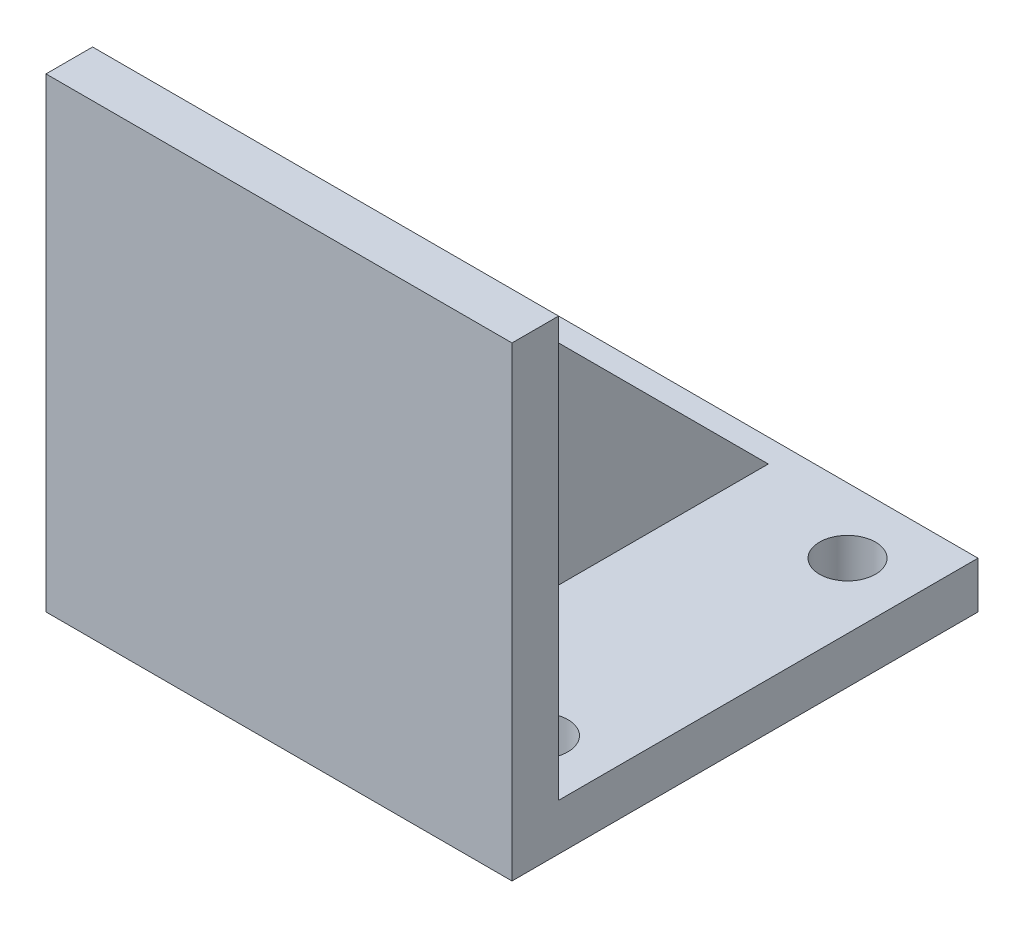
ISO-10303-21;
HEADER;
FILE_DESCRIPTION(('STEP AP214'),'2;1');
FILE_NAME('part.step','',(''),(''),'','','');
FILE_SCHEMA(('AUTOMOTIVE_DESIGN { 1 0 10303 214 1 1 1 1 }'));
ENDSEC;
DATA;
#1=APPLICATION_CONTEXT('core data for automotive mechanical design processes');
#2=APPLICATION_PROTOCOL_DEFINITION('international standard','automotive_design',2000,#1);
#3=PRODUCT_CONTEXT('',#1,'mechanical');
#4=PRODUCT('Part','Part','',(#3));
#5=PRODUCT_RELATED_PRODUCT_CATEGORY('part','',(#4));
#6=PRODUCT_DEFINITION_FORMATION('','',#4);
#7=PRODUCT_DEFINITION_CONTEXT('part definition',#1,'design');
#8=PRODUCT_DEFINITION('design','',#6,#7);
#9=PRODUCT_DEFINITION_SHAPE('','',#8);
#10=(LENGTH_UNIT() NAMED_UNIT(*) SI_UNIT(.MILLI.,.METRE.));
#11=(NAMED_UNIT(*) PLANE_ANGLE_UNIT() SI_UNIT($,.RADIAN.));
#12=(NAMED_UNIT(*) SI_UNIT($,.STERADIAN.) SOLID_ANGLE_UNIT());
#13=UNCERTAINTY_MEASURE_WITH_UNIT(LENGTH_MEASURE(1.E-05),#10,'distance_accuracy_value','');
#14=(GEOMETRIC_REPRESENTATION_CONTEXT(3) GLOBAL_UNCERTAINTY_ASSIGNED_CONTEXT((#13)) GLOBAL_UNIT_ASSIGNED_CONTEXT((#10,
#11,#12)) REPRESENTATION_CONTEXT('',''));
#15=CARTESIAN_POINT('',(0.,0.,0.));
#16=DIRECTION('',(0.,0.,1.));
#17=DIRECTION('',(1.,0.,0.));
#18=AXIS2_PLACEMENT_3D('',#15,#16,#17);
#19=CARTESIAN_POINT('',(100.,0.,-100.));
#20=DIRECTION('',(0.,1.,0.));
#21=DIRECTION('',(0.,0.,1.));
#22=AXIS2_PLACEMENT_3D('',#19,#20,#21);
#23=PLANE('',#22);
#24=CARTESIAN_POINT('',(86.,0.,-20.));
#25=DIRECTION('',(0.,1.,0.));
#26=DIRECTION('',(0.,0.,1.));
#27=AXIS2_PLACEMENT_3D('',#24,#25,#26);
#28=CIRCLE('',#27,6.);
#29=CARTESIAN_POINT('',(86.,0.,-14.));
#30=VERTEX_POINT('',#29);
#31=EDGE_CURVE('E226',#30,#30,#28,.T.);
#32=ORIENTED_EDGE('',*,*,#31,.T.);
#33=EDGE_LOOP('',(#32));
#34=FACE_BOUND('',#33,.T.);
#35=CARTESIAN_POINT('',(14.,0.,-20.));
#36=DIRECTION('',(0.,1.,0.));
#37=DIRECTION('',(0.,0.,1.));
#38=AXIS2_PLACEMENT_3D('',#35,#36,#37);
#39=CIRCLE('',#38,6.);
#40=CARTESIAN_POINT('',(14.,0.,-14.));
#41=VERTEX_POINT('',#40);
#42=EDGE_CURVE('E119',#41,#41,#39,.T.);
#43=ORIENTED_EDGE('',*,*,#42,.T.);
#44=EDGE_LOOP('',(#43));
#45=FACE_BOUND('',#44,.T.);
#46=CARTESIAN_POINT('',(86.,0.,-86.));
#47=DIRECTION('',(0.,1.,0.));
#48=DIRECTION('',(0.,0.,1.));
#49=AXIS2_PLACEMENT_3D('',#46,#47,#48);
#50=CIRCLE('',#49,6.);
#51=CARTESIAN_POINT('',(86.,0.,-80.));
#52=VERTEX_POINT('',#51);
#53=EDGE_CURVE('E139',#52,#52,#50,.T.);
#54=ORIENTED_EDGE('',*,*,#53,.T.);
#55=EDGE_LOOP('',(#54));
#56=FACE_BOUND('',#55,.T.);
#57=DIRECTION('',(-1.,0.,0.));
#58=VECTOR('',#57,1.);
#59=CARTESIAN_POINT('',(100.,0.,0.));
#60=LINE('',#59,#58);
#61=CARTESIAN_POINT('',(100.,0.,0.));
#62=VERTEX_POINT('',#61);
#63=CARTESIAN_POINT('',(0.,0.,0.));
#64=VERTEX_POINT('',#63);
#65=EDGE_CURVE('E157',#62,#64,#60,.T.);
#66=ORIENTED_EDGE('',*,*,#65,.T.);
#67=DIRECTION('',(0.,0.,-1.));
#68=VECTOR('',#67,1.);
#69=CARTESIAN_POINT('',(0.,0.,-100.));
#70=LINE('',#69,#68);
#71=CARTESIAN_POINT('',(0.,0.,-100.));
#72=VERTEX_POINT('',#71);
#73=EDGE_CURVE('E142',#64,#72,#70,.T.);
#74=ORIENTED_EDGE('',*,*,#73,.T.);
#75=DIRECTION('',(-1.,0.,0.));
#76=VECTOR('',#75,1.);
#77=CARTESIAN_POINT('',(100.,0.,-100.));
#78=LINE('',#77,#76);
#79=CARTESIAN_POINT('',(100.,0.,-100.));
#80=VERTEX_POINT('',#79);
#81=EDGE_CURVE('E11',#80,#72,#78,.T.);
#82=ORIENTED_EDGE('',*,*,#81,.F.);
#83=DIRECTION('',(0.,0.,-1.));
#84=VECTOR('',#83,1.);
#85=CARTESIAN_POINT('',(100.,0.,-100.));
#86=LINE('',#85,#84);
#87=EDGE_CURVE('E143',#62,#80,#86,.T.);
#88=ORIENTED_EDGE('',*,*,#87,.F.);
#89=EDGE_LOOP('',(#66,#74,#82,#88));
#90=FACE_BOUND('',#89,.T.);
#91=CARTESIAN_POINT('',(14.,0.,-86.));
#92=DIRECTION('',(0.,1.,0.));
#93=DIRECTION('',(0.,0.,1.));
#94=AXIS2_PLACEMENT_3D('',#91,#92,#93);
#95=CIRCLE('',#94,6.00000000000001);
#96=CARTESIAN_POINT('',(14.,0.,-80.));
#97=VERTEX_POINT('',#96);
#98=EDGE_CURVE('E133',#97,#97,#95,.T.);
#99=ORIENTED_EDGE('',*,*,#98,.T.);
#100=EDGE_LOOP('',(#99));
#101=FACE_BOUND('',#100,.T.);
#102=ADVANCED_FACE('F32',(#34,#45,#56,#90,#101),#23,.F.);
#103=CARTESIAN_POINT('',(100.,9.99999999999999,-100.));
#104=DIRECTION('',(0.,0.,1.));
#105=DIRECTION('',(1.,0.,0.));
#106=AXIS2_PLACEMENT_3D('',#103,#104,#105);
#107=PLANE('',#106);
#108=ORIENTED_EDGE('',*,*,#81,.T.);
#109=DIRECTION('',(0.,1.,0.));
#110=VECTOR('',#109,1.);
#111=CARTESIAN_POINT('',(0.,9.99999999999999,-100.));
#112=LINE('',#111,#110);
#113=CARTESIAN_POINT('',(0.,9.99999999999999,-100.));
#114=VERTEX_POINT('',#113);
#115=EDGE_CURVE('E160',#72,#114,#112,.T.);
#116=ORIENTED_EDGE('',*,*,#115,.T.);
#117=DIRECTION('',(-1.,0.,0.));
#118=VECTOR('',#117,1.);
#119=CARTESIAN_POINT('',(100.,9.99999999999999,-100.));
#120=LINE('',#119,#118);
#121=CARTESIAN_POINT('',(100.,9.99999999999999,-100.));
#122=VERTEX_POINT('',#121);
#123=EDGE_CURVE('E39',#122,#114,#120,.T.);
#124=ORIENTED_EDGE('',*,*,#123,.F.);
#125=DIRECTION('',(0.,1.,0.));
#126=VECTOR('',#125,1.);
#127=CARTESIAN_POINT('',(100.,9.99999999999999,-100.));
#128=LINE('',#127,#126);
#129=EDGE_CURVE('E146',#80,#122,#128,.T.);
#130=ORIENTED_EDGE('',*,*,#129,.F.);
#131=EDGE_LOOP('',(#108,#116,#124,#130));
#132=FACE_BOUND('',#131,.T.);
#133=ADVANCED_FACE('F218',(#132),#107,.F.);
#134=CARTESIAN_POINT('',(100.,9.99999999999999,-10.));
#135=DIRECTION('',(0.,-1.,0.));
#136=DIRECTION('',(0.,0.,-1.));
#137=AXIS2_PLACEMENT_3D('',#134,#135,#136);
#138=PLANE('',#137);
#139=CARTESIAN_POINT('',(86.,9.99999999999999,-20.));
#140=DIRECTION('',(0.,1.,0.));
#141=DIRECTION('',(0.,0.,1.));
#142=AXIS2_PLACEMENT_3D('',#139,#140,#141);
#143=CIRCLE('',#142,6.);
#144=CARTESIAN_POINT('',(86.,9.99999999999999,-14.));
#145=VERTEX_POINT('',#144);
#146=EDGE_CURVE('E264',#145,#145,#143,.T.);
#147=ORIENTED_EDGE('',*,*,#146,.F.);
#148=EDGE_LOOP('',(#147));
#149=FACE_BOUND('',#148,.T.);
#150=CARTESIAN_POINT('',(14.,9.99999999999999,-20.));
#151=DIRECTION('',(0.,1.,0.));
#152=DIRECTION('',(0.,0.,1.));
#153=AXIS2_PLACEMENT_3D('',#150,#151,#152);
#154=CIRCLE('',#153,6.);
#155=CARTESIAN_POINT('',(14.,9.99999999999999,-14.));
#156=VERTEX_POINT('',#155);
#157=EDGE_CURVE('E123',#156,#156,#154,.T.);
#158=ORIENTED_EDGE('',*,*,#157,.F.);
#159=EDGE_LOOP('',(#158));
#160=FACE_BOUND('',#159,.T.);
#161=CARTESIAN_POINT('',(14.,9.99999999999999,-86.));
#162=DIRECTION('',(0.,1.,0.));
#163=DIRECTION('',(0.,0.,1.));
#164=AXIS2_PLACEMENT_3D('',#161,#162,#163);
#165=CIRCLE('',#164,6.00000000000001);
#166=CARTESIAN_POINT('',(14.,9.99999999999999,-80.));
#167=VERTEX_POINT('',#166);
#168=EDGE_CURVE('E130',#167,#167,#165,.T.);
#169=ORIENTED_EDGE('',*,*,#168,.F.);
#170=EDGE_LOOP('',(#169));
#171=FACE_BOUND('',#170,.T.);
#172=CARTESIAN_POINT('',(86.,9.99999999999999,-86.));
#173=DIRECTION('',(0.,1.,0.));
#174=DIRECTION('',(0.,0.,1.));
#175=AXIS2_PLACEMENT_3D('',#172,#173,#174);
#176=CIRCLE('',#175,6.);
#177=CARTESIAN_POINT('',(86.,9.99999999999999,-80.));
#178=VERTEX_POINT('',#177);
#179=EDGE_CURVE('E136',#178,#178,#176,.T.);
#180=ORIENTED_EDGE('',*,*,#179,.F.);
#181=EDGE_LOOP('',(#180));
#182=FACE_BOUND('',#181,.T.);
#183=DIRECTION('',(-1.,0.,0.));
#184=VECTOR('',#183,1.);
#185=CARTESIAN_POINT('',(100.,9.99999999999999,-95.));
#186=LINE('',#185,#184);
#187=CARTESIAN_POINT('',(40.,9.99999999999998,-95.));
#188=VERTEX_POINT('',#187);
#189=CARTESIAN_POINT('',(60.,9.99999999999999,-95.));
#190=VERTEX_POINT('',#189);
#191=EDGE_CURVE('E46',#188,#190,#186,.F.);
#192=ORIENTED_EDGE('',*,*,#191,.T.);
#193=DIRECTION('',(0.,0.,1.));
#194=VECTOR('',#193,1.);
#195=CARTESIAN_POINT('',(60.,9.99999999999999,-10.));
#196=LINE('',#195,#194);
#197=CARTESIAN_POINT('',(60.,9.99999999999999,-10.));
#198=VERTEX_POINT('',#197);
#199=EDGE_CURVE('E110',#190,#198,#196,.T.);
#200=ORIENTED_EDGE('',*,*,#199,.T.);
#201=DIRECTION('',(-1.,0.,0.));
#202=VECTOR('',#201,1.);
#203=CARTESIAN_POINT('',(100.,9.99999999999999,-10.));
#204=LINE('',#203,#202);
#205=CARTESIAN_POINT('',(100.,9.99999999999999,-10.));
#206=VERTEX_POINT('',#205);
#207=EDGE_CURVE('E179',#206,#198,#204,.T.);
#208=ORIENTED_EDGE('',*,*,#207,.F.);
#209=DIRECTION('',(0.,0.,1.));
#210=VECTOR('',#209,1.);
#211=CARTESIAN_POINT('',(100.,9.99999999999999,-10.));
#212=LINE('',#211,#210);
#213=EDGE_CURVE('E149',#122,#206,#212,.T.);
#214=ORIENTED_EDGE('',*,*,#213,.F.);
#215=ORIENTED_EDGE('',*,*,#123,.T.);
#216=DIRECTION('',(0.,0.,1.));
#217=VECTOR('',#216,1.);
#218=CARTESIAN_POINT('',(0.,9.99999999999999,-10.));
#219=LINE('',#218,#217);
#220=CARTESIAN_POINT('',(0.,9.99999999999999,-10.));
#221=VERTEX_POINT('',#220);
#222=EDGE_CURVE('E162',#114,#221,#219,.T.);
#223=ORIENTED_EDGE('',*,*,#222,.T.);
#224=CARTESIAN_POINT('',(40.,9.99999999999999,-10.));
#225=VERTEX_POINT('',#224);
#226=EDGE_CURVE('E178',#225,#221,#204,.T.);
#227=ORIENTED_EDGE('',*,*,#226,.F.);
#228=DIRECTION('',(0.,0.,1.));
#229=VECTOR('',#228,1.);
#230=CARTESIAN_POINT('',(40.,9.99999999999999,-10.));
#231=LINE('',#230,#229);
#232=EDGE_CURVE('E51',#188,#225,#231,.T.);
#233=ORIENTED_EDGE('',*,*,#232,.F.);
#234=EDGE_LOOP('',(#192,#200,#208,#214,#215,#223,#227,#233));
#235=FACE_BOUND('',#234,.T.);
#236=ADVANCED_FACE('F184',(#149,#160,#171,#182,#235),#138,.F.);
#237=CARTESIAN_POINT('',(100.,100.,-10.));
#238=DIRECTION('',(0.,0.,1.));
#239=DIRECTION('',(0.,-1.,0.));
#240=AXIS2_PLACEMENT_3D('',#237,#238,#239);
#241=PLANE('',#240);
#242=ORIENTED_EDGE('',*,*,#207,.T.);
#243=DIRECTION('',(0.,1.,0.));
#244=VECTOR('',#243,1.);
#245=CARTESIAN_POINT('',(60.,100.,-10.));
#246=LINE('',#245,#244);
#247=CARTESIAN_POINT('',(60.,95.,-10.));
#248=VERTEX_POINT('',#247);
#249=EDGE_CURVE('E105',#198,#248,#246,.T.);
#250=ORIENTED_EDGE('',*,*,#249,.T.);
#251=DIRECTION('',(1.,0.,0.));
#252=VECTOR('',#251,1.);
#253=CARTESIAN_POINT('',(100.,95.,-10.));
#254=LINE('',#253,#252);
#255=CARTESIAN_POINT('',(40.,95.,-10.));
#256=VERTEX_POINT('',#255);
#257=EDGE_CURVE('E99',#248,#256,#254,.F.);
#258=ORIENTED_EDGE('',*,*,#257,.T.);
#259=DIRECTION('',(0.,1.,0.));
#260=VECTOR('',#259,1.);
#261=CARTESIAN_POINT('',(40.,100.,-10.));
#262=LINE('',#261,#260);
#263=EDGE_CURVE('E103',#225,#256,#262,.T.);
#264=ORIENTED_EDGE('',*,*,#263,.F.);
#265=ORIENTED_EDGE('',*,*,#226,.T.);
#266=DIRECTION('',(0.,1.,0.));
#267=VECTOR('',#266,1.);
#268=CARTESIAN_POINT('',(0.,100.,-10.));
#269=LINE('',#268,#267);
#270=CARTESIAN_POINT('',(0.,100.,-10.));
#271=VERTEX_POINT('',#270);
#272=EDGE_CURVE('E165',#221,#271,#269,.T.);
#273=ORIENTED_EDGE('',*,*,#272,.T.);
#274=DIRECTION('',(-1.,0.,0.));
#275=VECTOR('',#274,1.);
#276=CARTESIAN_POINT('',(100.,100.,-10.));
#277=LINE('',#276,#275);
#278=CARTESIAN_POINT('',(100.,100.,-10.));
#279=VERTEX_POINT('',#278);
#280=EDGE_CURVE('E175',#279,#271,#277,.T.);
#281=ORIENTED_EDGE('',*,*,#280,.F.);
#282=DIRECTION('',(0.,1.,0.));
#283=VECTOR('',#282,1.);
#284=CARTESIAN_POINT('',(100.,100.,-10.));
#285=LINE('',#284,#283);
#286=EDGE_CURVE('E151',#206,#279,#285,.T.);
#287=ORIENTED_EDGE('',*,*,#286,.F.);
#288=EDGE_LOOP('',(#242,#250,#258,#264,#265,#273,#281,#287));
#289=FACE_BOUND('',#288,.T.);
#290=ADVANCED_FACE('F102',(#289),#241,.F.);
#291=CARTESIAN_POINT('',(100.,100.,0.));
#292=DIRECTION('',(0.,-1.,0.));
#293=DIRECTION('',(0.,0.,-1.));
#294=AXIS2_PLACEMENT_3D('',#291,#292,#293);
#295=PLANE('',#294);
#296=DIRECTION('',(0.,0.,1.));
#297=VECTOR('',#296,1.);
#298=CARTESIAN_POINT('',(0.,100.,0.));
#299=LINE('',#298,#297);
#300=CARTESIAN_POINT('',(0.,100.,0.));
#301=VERTEX_POINT('',#300);
#302=EDGE_CURVE('E167',#271,#301,#299,.T.);
#303=ORIENTED_EDGE('',*,*,#302,.T.);
#304=DIRECTION('',(-1.,0.,0.));
#305=VECTOR('',#304,1.);
#306=CARTESIAN_POINT('',(100.,100.,0.));
#307=LINE('',#306,#305);
#308=CARTESIAN_POINT('',(100.,100.,0.));
#309=VERTEX_POINT('',#308);
#310=EDGE_CURVE('E173',#309,#301,#307,.T.);
#311=ORIENTED_EDGE('',*,*,#310,.F.);
#312=DIRECTION('',(0.,0.,1.));
#313=VECTOR('',#312,1.);
#314=CARTESIAN_POINT('',(100.,100.,0.));
#315=LINE('',#314,#313);
#316=EDGE_CURVE('E153',#279,#309,#315,.T.);
#317=ORIENTED_EDGE('',*,*,#316,.F.);
#318=ORIENTED_EDGE('',*,*,#280,.T.);
#319=EDGE_LOOP('',(#303,#311,#317,#318));
#320=FACE_BOUND('',#319,.T.);
#321=ADVANCED_FACE('F198',(#320),#295,.F.);
#322=CARTESIAN_POINT('',(100.,0.,0.));
#323=DIRECTION('',(0.,0.,-1.));
#324=DIRECTION('',(-1.,0.,0.));
#325=AXIS2_PLACEMENT_3D('',#322,#323,#324);
#326=PLANE('',#325);
#327=ORIENTED_EDGE('',*,*,#310,.T.);
#328=DIRECTION('',(0.,-1.,0.));
#329=VECTOR('',#328,1.);
#330=CARTESIAN_POINT('',(0.,0.,0.));
#331=LINE('',#330,#329);
#332=EDGE_CURVE('E147',#301,#64,#331,.T.);
#333=ORIENTED_EDGE('',*,*,#332,.T.);
#334=ORIENTED_EDGE('',*,*,#65,.F.);
#335=DIRECTION('',(0.,-1.,0.));
#336=VECTOR('',#335,1.);
#337=CARTESIAN_POINT('',(100.,0.,0.));
#338=LINE('',#337,#336);
#339=EDGE_CURVE('E155',#309,#62,#338,.T.);
#340=ORIENTED_EDGE('',*,*,#339,.F.);
#341=EDGE_LOOP('',(#327,#333,#334,#340));
#342=FACE_BOUND('',#341,.T.);
#343=ADVANCED_FACE('F247',(#342),#326,.F.);
#344=CARTESIAN_POINT('',(100.,0.,0.));
#345=DIRECTION('',(-1.,0.,0.));
#346=DIRECTION('',(0.,0.,1.));
#347=AXIS2_PLACEMENT_3D('',#344,#345,#346);
#348=PLANE('',#347);
#349=ORIENTED_EDGE('',*,*,#87,.T.);
#350=ORIENTED_EDGE('',*,*,#129,.T.);
#351=ORIENTED_EDGE('',*,*,#213,.T.);
#352=ORIENTED_EDGE('',*,*,#286,.T.);
#353=ORIENTED_EDGE('',*,*,#316,.T.);
#354=ORIENTED_EDGE('',*,*,#339,.T.);
#355=EDGE_LOOP('',(#349,#350,#351,#352,#353,#354));
#356=FACE_BOUND('',#355,.T.);
#357=ADVANCED_FACE('F202',(#356),#348,.F.);
#358=CARTESIAN_POINT('',(0.,0.,0.));
#359=DIRECTION('',(-1.,0.,0.));
#360=DIRECTION('',(0.,0.,1.));
#361=AXIS2_PLACEMENT_3D('',#358,#359,#360);
#362=PLANE('',#361);
#363=ORIENTED_EDGE('',*,*,#73,.F.);
#364=ORIENTED_EDGE('',*,*,#332,.F.);
#365=ORIENTED_EDGE('',*,*,#302,.F.);
#366=ORIENTED_EDGE('',*,*,#272,.F.);
#367=ORIENTED_EDGE('',*,*,#222,.F.);
#368=ORIENTED_EDGE('',*,*,#115,.F.);
#369=EDGE_LOOP('',(#363,#364,#365,#366,#367,#368));
#370=FACE_BOUND('',#369,.T.);
#371=ADVANCED_FACE('F191',(#370),#362,.T.);
#372=CARTESIAN_POINT('',(86.,-90.,-86.));
#373=DIRECTION('',(0.,1.,0.));
#374=DIRECTION('',(0.,0.,1.));
#375=AXIS2_PLACEMENT_3D('',#372,#373,#374);
#376=CYLINDRICAL_SURFACE('',#375,6.);
#377=ORIENTED_EDGE('',*,*,#179,.T.);
#378=EDGE_LOOP('',(#377));
#379=FACE_BOUND('',#378,.T.);
#380=ORIENTED_EDGE('',*,*,#53,.F.);
#381=EDGE_LOOP('',(#380));
#382=FACE_BOUND('',#381,.T.);
#383=ADVANCED_FACE('F236',(#379,#382),#376,.F.);
#384=CARTESIAN_POINT('',(14.,-90.,-86.));
#385=DIRECTION('',(0.,1.,0.));
#386=DIRECTION('',(0.,0.,1.));
#387=AXIS2_PLACEMENT_3D('',#384,#385,#386);
#388=CYLINDRICAL_SURFACE('',#387,6.00000000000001);
#389=ORIENTED_EDGE('',*,*,#168,.T.);
#390=EDGE_LOOP('',(#389));
#391=FACE_BOUND('',#390,.T.);
#392=ORIENTED_EDGE('',*,*,#98,.F.);
#393=EDGE_LOOP('',(#392));
#394=FACE_BOUND('',#393,.T.);
#395=ADVANCED_FACE('F214',(#391,#394),#388,.F.);
#396=CARTESIAN_POINT('',(50.,100.,-5.));
#397=DIRECTION('',(0.,-0.707106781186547,0.707106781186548));
#398=DIRECTION('',(0.,-0.707106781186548,-0.707106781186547));
#399=AXIS2_PLACEMENT_3D('',#396,#397,#398);
#400=PLANE('',#399);
#401=ORIENTED_EDGE('',*,*,#191,.F.);
#402=DIRECTION('',(0.,-0.707106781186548,-0.707106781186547));
#403=VECTOR('',#402,1.);
#404=CARTESIAN_POINT('',(40.,100.,-5.));
#405=LINE('',#404,#403);
#406=EDGE_CURVE('E115',#256,#188,#405,.T.);
#407=ORIENTED_EDGE('',*,*,#406,.F.);
#408=ORIENTED_EDGE('',*,*,#257,.F.);
#409=DIRECTION('',(0.,-0.707106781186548,-0.707106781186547));
#410=VECTOR('',#409,1.);
#411=CARTESIAN_POINT('',(60.,100.,-5.));
#412=LINE('',#411,#410);
#413=EDGE_CURVE('E116',#248,#190,#412,.T.);
#414=ORIENTED_EDGE('',*,*,#413,.T.);
#415=EDGE_LOOP('',(#401,#407,#408,#414));
#416=FACE_BOUND('',#415,.T.);
#417=ADVANCED_FACE('F118',(#416),#400,.F.);
#418=CARTESIAN_POINT('',(60.,50.,-50.));
#419=DIRECTION('',(1.,0.,0.));
#420=DIRECTION('',(0.,0.,-1.));
#421=AXIS2_PLACEMENT_3D('',#418,#419,#420);
#422=PLANE('',#421);
#423=ORIENTED_EDGE('',*,*,#199,.F.);
#424=ORIENTED_EDGE('',*,*,#413,.F.);
#425=ORIENTED_EDGE('',*,*,#249,.F.);
#426=EDGE_LOOP('',(#423,#424,#425));
#427=FACE_BOUND('',#426,.T.);
#428=ADVANCED_FACE('F205',(#427),#422,.T.);
#429=CARTESIAN_POINT('',(40.,50.,-50.));
#430=DIRECTION('',(1.,0.,0.));
#431=DIRECTION('',(0.,0.,-1.));
#432=AXIS2_PLACEMENT_3D('',#429,#430,#431);
#433=PLANE('',#432);
#434=ORIENTED_EDGE('',*,*,#406,.T.);
#435=ORIENTED_EDGE('',*,*,#232,.T.);
#436=ORIENTED_EDGE('',*,*,#263,.T.);
#437=EDGE_LOOP('',(#434,#435,#436));
#438=FACE_BOUND('',#437,.T.);
#439=ADVANCED_FACE('F114',(#438),#433,.F.);
#440=CARTESIAN_POINT('',(14.,-90.,-20.));
#441=DIRECTION('',(0.,1.,0.));
#442=DIRECTION('',(0.,0.,1.));
#443=AXIS2_PLACEMENT_3D('',#440,#441,#442);
#444=CYLINDRICAL_SURFACE('',#443,6.);
#445=ORIENTED_EDGE('',*,*,#157,.T.);
#446=EDGE_LOOP('',(#445));
#447=FACE_BOUND('',#446,.T.);
#448=ORIENTED_EDGE('',*,*,#42,.F.);
#449=EDGE_LOOP('',(#448));
#450=FACE_BOUND('',#449,.T.);
#451=ADVANCED_FACE('F212',(#447,#450),#444,.F.);
#452=CARTESIAN_POINT('',(86.,-90.,-20.));
#453=DIRECTION('',(0.,1.,0.));
#454=DIRECTION('',(0.,0.,1.));
#455=AXIS2_PLACEMENT_3D('',#452,#453,#454);
#456=CYLINDRICAL_SURFACE('',#455,6.);
#457=ORIENTED_EDGE('',*,*,#146,.T.);
#458=EDGE_LOOP('',(#457));
#459=FACE_BOUND('',#458,.T.);
#460=ORIENTED_EDGE('',*,*,#31,.F.);
#461=EDGE_LOOP('',(#460));
#462=FACE_BOUND('',#461,.T.);
#463=ADVANCED_FACE('F277',(#459,#462),#456,.F.);
#464=CLOSED_SHELL('',(#102,#133,#236,#290,#321,#343,#357,#371,#383,#395,#417,#428,#439,#451,#463));
#465=MANIFOLD_SOLID_BREP('B2',#464);
#466=ADVANCED_BREP_SHAPE_REPRESENTATION('',(#18,#465),#14);
#467=SHAPE_DEFINITION_REPRESENTATION(#9,#466);
ENDSEC;
END-ISO-10303-21;
